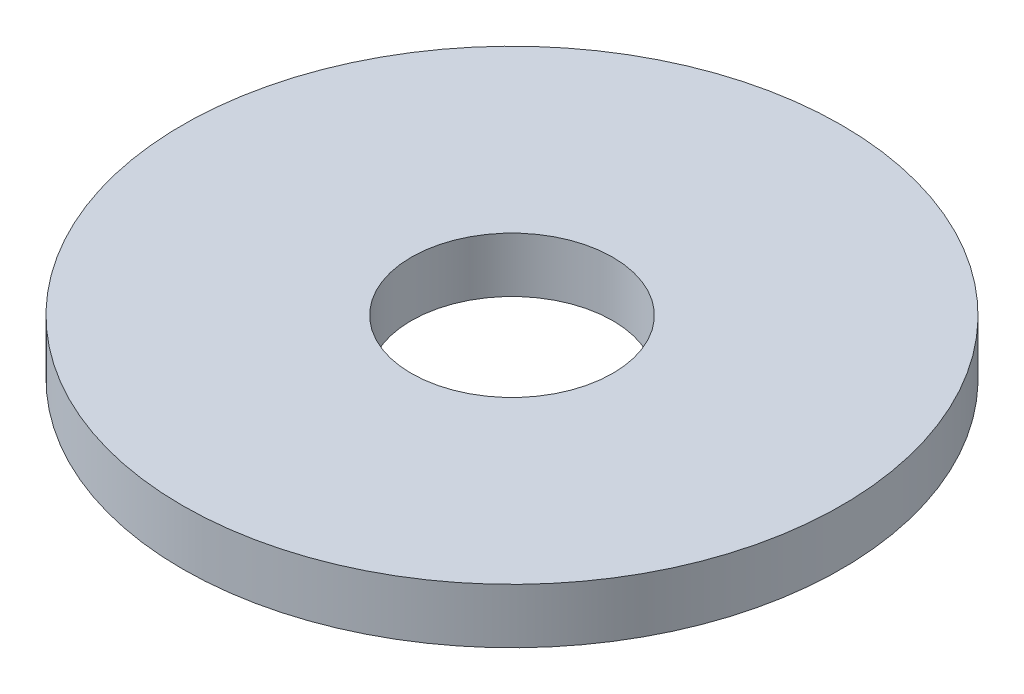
from build123d import *

# Parameters (mm, degrees)
SKETCH1_R          = 36
BASE_EXTRUDE_DEPTH = 6
SKETCH2_R          = 11
TYPE_R_DEPTH       = 52.264022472


with BuildPart() as part:
    # Sketch1 → Base-Extrude (new body)
    with BuildSketch(Plane(origin=(0, 0, 0), x_dir=(1, 0, 0), z_dir=(0, 1, 0))):
        with Locations(Location((0, 0, 0), (0, 0, 270))):
            Circle(SKETCH1_R)
    extrude(amount=-BASE_EXTRUDE_DEPTH)

    # Sketch2 → Type-R (cut, through all)
    with BuildSketch(Plane(origin=(0, 0, 0), x_dir=(-1, 0, 0), z_dir=(0, 1, 0))):
        with Locations(Location((0, 0, 0), (0, 0, 90))):
            Circle(SKETCH2_R)
    extrude(amount=-TYPE_R_DEPTH, mode=Mode.SUBTRACT)


solid = part.part
